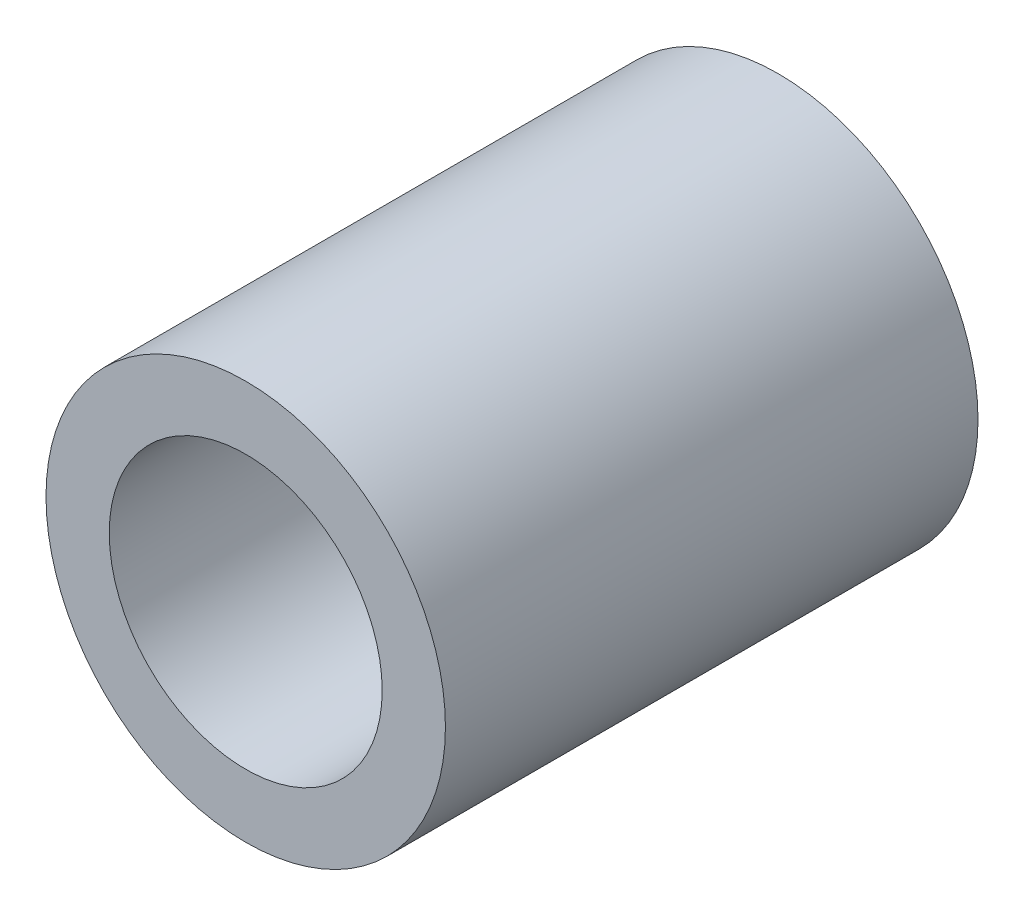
from build123d import *

# Parameters (mm, degrees)
ESQUISSE1_R             = 15
ESQUISSE1_R_2           = 10.25
BASE_EXTRUSION_DEPTH    = 40
ESQUISSE2_R             = 3
ENL_V_MAT_EXTRU_1_DEPTH = 20


with BuildPart() as part:
    # Esquisse1 → Base-Extrusion (new body)
    with BuildSketch(Plane.XY):
        Circle(ESQUISSE1_R)
        Circle(ESQUISSE1_R_2, mode=Mode.SUBTRACT)
    extrude(amount=BASE_EXTRUSION_DEPTH)

    # Esquisse2 → Enl_v. mat.-Extru.1 (cut)
    with BuildSketch(Plane(origin=(0, 0, 0), x_dir=(1, 0, 0), z_dir=(0, 1, 0))):
        with Locations(Location((0, -20, 0), (0, 0, 270))):
            Circle(ESQUISSE2_R)
    extrude(amount=-ENL_V_MAT_EXTRU_1_DEPTH, mode=Mode.SUBTRACT)


solid = part.part
